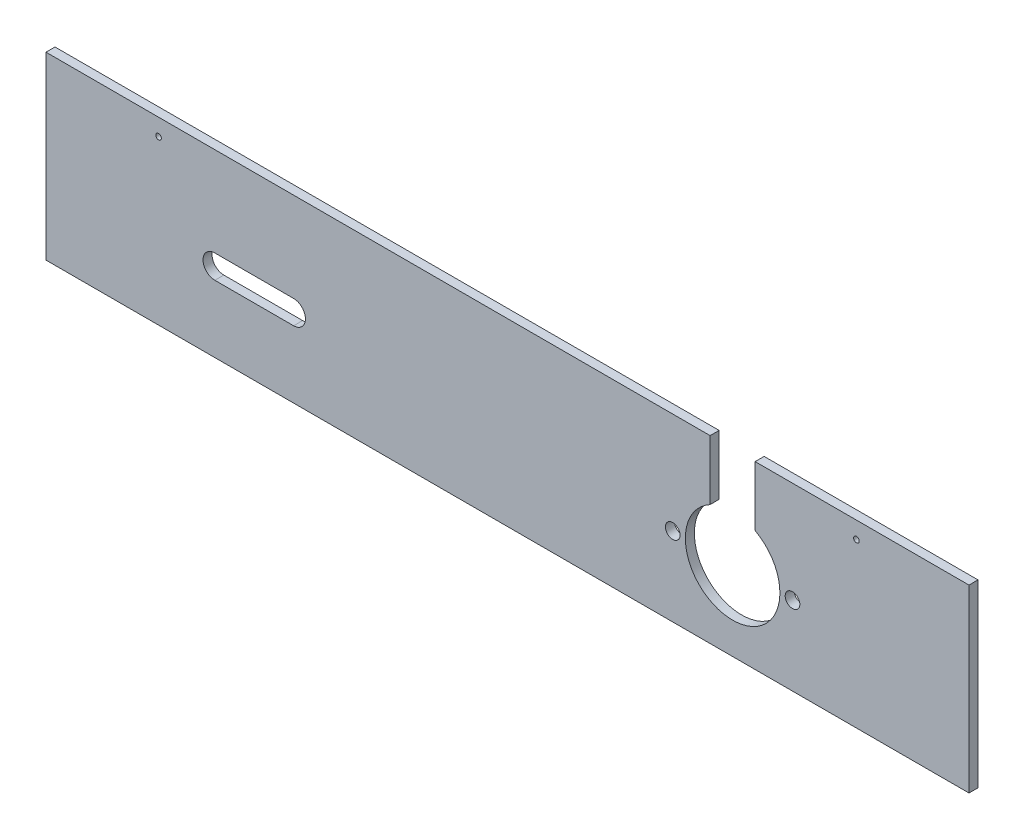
from build123d import *

# Parameters (mm, degrees)
ESQUISSE1_W             = 820
ESQUISSE1_H             = 160
ESQUISSE1_R             = 2.5
BASE_EXTRUSION_DEPTH    = 8
ESQUISSE2_R             = 6.5
ENL_V_MAT_EXTRU_1_DEPTH = 836.502244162


with BuildPart() as part:
    # Esquisse1 → Base-Extrusion (new body)
    with BuildSketch(Plane.XY):
        with Locations((410, -80)):
            Rectangle(ESQUISSE1_W, ESQUISSE1_H)
        with Locations((720, -15)):
            Circle(ESQUISSE1_R, mode=Mode.SUBTRACT)
        with Locations((100, -15)):
            Circle(ESQUISSE1_R, mode=Mode.SUBTRACT)
        with BuildLine():
            Line((150, -79.5), (220, -79.5))
            ThreePointArc((220, -79.5), (230.5, -90), (220, -100.5))
            Line((220, -100.5), (150, -100.5))
            ThreePointArc((150, -100.5), (139.5, -90), (150, -79.5))
        make_face(mode=Mode.SUBTRACT)
    extrude(amount=BASE_EXTRUSION_DEPTH)

    # Esquisse2 → Enl_v. mat.-Extru.1 (cut, through all)
    with BuildSketch(Plane.XY.offset(8)):
        with Locations((663.2, -90)):
            Circle(ESQUISSE2_R)
        with Locations((556.8, -90)):
            Circle(ESQUISSE2_R)
        with BuildLine():
            Line((630, -53.067629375), (630, 0))
            Line((630, 0), (590, 0))
            Line((590, 0), (590, -53.067629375))
            ThreePointArc((590, -53.067629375), (610, -132), (630, -53.067629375))
        make_face()
    extrude(amount=-ENL_V_MAT_EXTRU_1_DEPTH, mode=Mode.SUBTRACT)


solid = part.part
